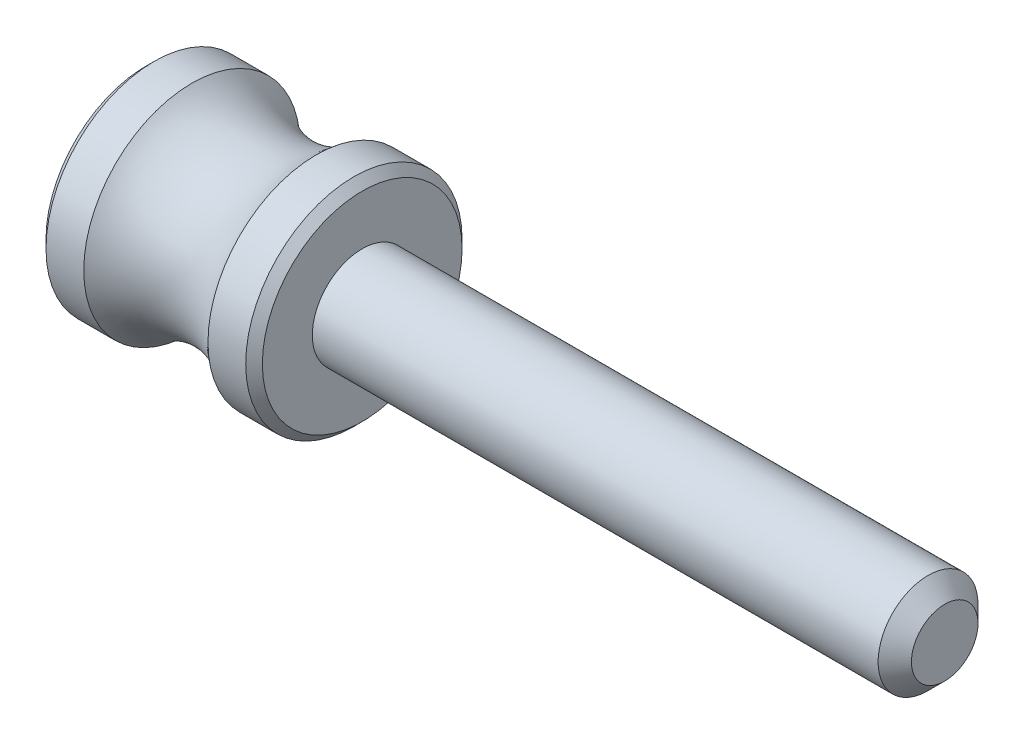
ISO-10303-21;
HEADER;
FILE_DESCRIPTION(('STEP AP214'),'2;1');
FILE_NAME('part.step','',(''),(''),'','','');
FILE_SCHEMA(('AUTOMOTIVE_DESIGN { 1 0 10303 214 1 1 1 1 }'));
ENDSEC;
DATA;
#1=APPLICATION_CONTEXT('core data for automotive mechanical design processes');
#2=APPLICATION_PROTOCOL_DEFINITION('international standard','automotive_design',2000,#1);
#3=PRODUCT_CONTEXT('',#1,'mechanical');
#4=PRODUCT('Part','Part','',(#3));
#5=PRODUCT_RELATED_PRODUCT_CATEGORY('part','',(#4));
#6=PRODUCT_DEFINITION_FORMATION('','',#4);
#7=PRODUCT_DEFINITION_CONTEXT('part definition',#1,'design');
#8=PRODUCT_DEFINITION('design','',#6,#7);
#9=PRODUCT_DEFINITION_SHAPE('','',#8);
#10=(LENGTH_UNIT() NAMED_UNIT(*) SI_UNIT(.MILLI.,.METRE.));
#11=(NAMED_UNIT(*) PLANE_ANGLE_UNIT() SI_UNIT($,.RADIAN.));
#12=(NAMED_UNIT(*) SI_UNIT($,.STERADIAN.) SOLID_ANGLE_UNIT());
#13=UNCERTAINTY_MEASURE_WITH_UNIT(LENGTH_MEASURE(1.E-05),#10,'distance_accuracy_value','');
#14=(GEOMETRIC_REPRESENTATION_CONTEXT(3) GLOBAL_UNCERTAINTY_ASSIGNED_CONTEXT((#13)) GLOBAL_UNIT_ASSIGNED_CONTEXT((#10,
#11,#12)) REPRESENTATION_CONTEXT('',''));
#15=CARTESIAN_POINT('',(0.,0.,0.));
#16=DIRECTION('',(0.,0.,1.));
#17=DIRECTION('',(1.,0.,0.));
#18=AXIS2_PLACEMENT_3D('',#15,#16,#17);
#19=CARTESIAN_POINT('',(13.,0.,0.));
#20=DIRECTION('',(-1.,0.,0.));
#21=DIRECTION('',(0.,0.,1.));
#22=AXIS2_PLACEMENT_3D('',#19,#20,#21);
#23=CYLINDRICAL_SURFACE('',#22,6.5);
#24=CARTESIAN_POINT('',(0.500000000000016,0.,0.));
#25=DIRECTION('',(1.,0.,0.));
#26=DIRECTION('',(0.,0.,-1.));
#27=AXIS2_PLACEMENT_3D('',#24,#25,#26);
#28=CIRCLE('',#27,6.5);
#29=CARTESIAN_POINT('',(0.500000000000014,0.,6.5));
#30=VERTEX_POINT('',#29);
#31=EDGE_CURVE('E45',#30,#30,#28,.T.);
#32=CARTESIAN_POINT('',(2.76787230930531,0.,0.));
#33=DIRECTION('',(-1.,0.,0.));
#34=DIRECTION('',(0.,0.,1.));
#35=AXIS2_PLACEMENT_3D('',#32,#33,#34);
#36=CIRCLE('',#35,6.5);
#37=CARTESIAN_POINT('',(2.76787230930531,0.,6.5));
#38=VERTEX_POINT('',#37);
#39=EDGE_CURVE('E59',#38,#38,#36,.T.);
#40=CARTESIAN_POINT('',(0.500000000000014,0.,6.5));
#41=CARTESIAN_POINT('',(0.523623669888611,0.,6.5));
#42=CARTESIAN_POINT('',(0.547247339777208,0.,6.5));
#43=CARTESIAN_POINT('',(0.594494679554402,0.,6.5));
#44=CARTESIAN_POINT('',(0.618118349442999,0.,6.5));
#45=CARTESIAN_POINT('',(0.665365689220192,0.,6.5));
#46=CARTESIAN_POINT('',(0.688989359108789,0.,6.5));
#47=CARTESIAN_POINT('',(0.736236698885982,0.,6.5));
#48=CARTESIAN_POINT('',(0.759860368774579,0.,6.5));
#49=CARTESIAN_POINT('',(0.807107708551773,0.,6.5));
#50=CARTESIAN_POINT('',(0.83073137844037,0.,6.5));
#51=CARTESIAN_POINT('',(0.877978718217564,0.,6.5));
#52=CARTESIAN_POINT('',(0.901602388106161,0.,6.5));
#53=CARTESIAN_POINT('',(0.948849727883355,0.,6.5));
#54=CARTESIAN_POINT('',(0.972473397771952,0.,6.5));
#55=CARTESIAN_POINT('',(1.01972073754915,0.,6.5));
#56=CARTESIAN_POINT('',(1.04334440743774,0.,6.5));
#57=CARTESIAN_POINT('',(1.09059174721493,0.,6.5));
#58=CARTESIAN_POINT('',(1.11421541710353,0.,6.5));
#59=CARTESIAN_POINT('',(1.16146275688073,0.,6.5));
#60=CARTESIAN_POINT('',(1.18508642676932,0.,6.5));
#61=CARTESIAN_POINT('',(1.23233376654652,0.,6.5));
#62=CARTESIAN_POINT('',(1.25595743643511,0.,6.5));
#63=CARTESIAN_POINT('',(1.30320477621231,0.,6.5));
#64=CARTESIAN_POINT('',(1.3268284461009,0.,6.5));
#65=CARTESIAN_POINT('',(1.3740757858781,0.,6.5));
#66=CARTESIAN_POINT('',(1.3976994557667,0.,6.5));
#67=CARTESIAN_POINT('',(1.44494679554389,0.,6.5));
#68=CARTESIAN_POINT('',(1.46857046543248,0.,6.5));
#69=CARTESIAN_POINT('',(1.51581780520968,0.,6.5));
#70=CARTESIAN_POINT('',(1.53944147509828,0.,6.5));
#71=CARTESIAN_POINT('',(1.58668881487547,0.,6.5));
#72=CARTESIAN_POINT('',(1.61031248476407,0.,6.5));
#73=CARTESIAN_POINT('',(1.65755982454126,0.,6.5));
#74=CARTESIAN_POINT('',(1.68118349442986,0.,6.5));
#75=CARTESIAN_POINT('',(1.72843083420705,0.,6.5));
#76=CARTESIAN_POINT('',(1.75205450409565,0.,6.5));
#77=CARTESIAN_POINT('',(1.79930184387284,0.,6.5));
#78=CARTESIAN_POINT('',(1.82292551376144,0.,6.5));
#79=CARTESIAN_POINT('',(1.87017285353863,0.,6.5));
#80=CARTESIAN_POINT('',(1.89379652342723,0.,6.5));
#81=CARTESIAN_POINT('',(1.94104386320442,0.,6.5));
#82=CARTESIAN_POINT('',(1.96466753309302,0.,6.5));
#83=CARTESIAN_POINT('',(2.01191487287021,0.,6.5));
#84=CARTESIAN_POINT('',(2.03553854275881,0.,6.5));
#85=CARTESIAN_POINT('',(2.082785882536,0.,6.5));
#86=CARTESIAN_POINT('',(2.1064095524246,0.,6.5));
#87=CARTESIAN_POINT('',(2.15365689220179,0.,6.5));
#88=CARTESIAN_POINT('',(2.17728056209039,0.,6.5));
#89=CARTESIAN_POINT('',(2.22452790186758,0.,6.5));
#90=CARTESIAN_POINT('',(2.24815157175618,0.,6.5));
#91=CARTESIAN_POINT('',(2.29539891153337,0.,6.5));
#92=CARTESIAN_POINT('',(2.31902258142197,0.,6.5));
#93=CARTESIAN_POINT('',(2.36626992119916,0.,6.5));
#94=CARTESIAN_POINT('',(2.38989359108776,0.,6.5));
#95=CARTESIAN_POINT('',(2.43714093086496,0.,6.5));
#96=CARTESIAN_POINT('',(2.46076460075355,0.,6.5));
#97=CARTESIAN_POINT('',(2.50801194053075,0.,6.5));
#98=CARTESIAN_POINT('',(2.53163561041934,0.,6.5));
#99=CARTESIAN_POINT('',(2.57888295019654,0.,6.5));
#100=CARTESIAN_POINT('',(2.60250662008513,0.,6.5));
#101=CARTESIAN_POINT('',(2.64975395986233,0.,6.5));
#102=CARTESIAN_POINT('',(2.67337762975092,0.,6.5));
#103=CARTESIAN_POINT('',(2.72062496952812,0.,6.5));
#104=CARTESIAN_POINT('',(2.74424863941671,0.,6.5));
#105=CARTESIAN_POINT('',(2.76787230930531,0.,6.5));
#106=B_SPLINE_CURVE_WITH_KNOTS('',3,(#40,#41,#42,#43,#44,#45,#46,#47,#48,#49,#50,#51,#52,#53,
#54,#55,#56,#57,#58,#59,#60,#61,#62,#63,#64,#65,#66,#67,#68,#69,#70,#71,#72,#73,#74,#75,#76,#77,
#78,#79,#80,#81,#82,#83,#84,#85,#86,#87,#88,#89,#90,#91,#92,#93,#94,#95,#96,#97,#98,#99,#100,
#101,#102,#103,#104,#105),.UNSPECIFIED.,.F.,.F.,(4,2,2,2,2,2,2,2,2,2,2,2,2,2,2,2,2,2,2,2,2,2,2,
2,2,2,2,2,2,2,2,2,4),(0.,0.0708710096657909,0.141742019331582,0.212613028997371,
0.283484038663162,0.354355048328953,0.425226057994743,0.496097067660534,0.566968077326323,
0.637839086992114,0.708710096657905,0.779581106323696,0.850452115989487,0.921323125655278,
0.992194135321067,1.06306514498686,1.13393615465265,1.20480716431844,1.27567817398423,
1.34654918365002,1.41742019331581,1.4882912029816,1.55916221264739,1.63003322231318,
1.70090423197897,1.77177524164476,1.84264625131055,1.91351726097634,1.98438827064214,
2.05525928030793,2.12613028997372,2.19700129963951,2.2678723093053),.UNSPECIFIED.);
#107=EDGE_CURVE('BSEAM30',#30,#38,#106,.T.);
#108=ORIENTED_EDGE('',*,*,#31,.T.);
#109=ORIENTED_EDGE('',*,*,#39,.T.);
#110=ORIENTED_EDGE('',*,*,#107,.T.);
#111=ORIENTED_EDGE('',*,*,#107,.F.);
#112=EDGE_LOOP('',(#108,#110,#109,#111));
#113=FACE_BOUND('',#112,.T.);
#114=ADVANCED_FACE('F30',(#113),#23,.T.);
#115=CARTESIAN_POINT('',(0.,0.,0.));
#116=DIRECTION('',(1.,0.,0.));
#117=DIRECTION('',(0.,0.,-1.));
#118=AXIS2_PLACEMENT_3D('',#115,#116,#117);
#119=PLANE('',#118);
#120=CARTESIAN_POINT('',(0.,0.,0.));
#121=DIRECTION('',(1.,0.,0.));
#122=DIRECTION('',(0.,0.,-1.));
#123=AXIS2_PLACEMENT_3D('',#120,#121,#122);
#124=CIRCLE('',#123,5.99999999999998);
#125=CARTESIAN_POINT('',(0.,0.,-5.99999999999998));
#126=VERTEX_POINT('',#125);
#127=EDGE_CURVE('E41',#126,#126,#124,.F.);
#128=ORIENTED_EDGE('',*,*,#127,.T.);
#129=EDGE_LOOP('',(#128));
#130=FACE_BOUND('',#129,.T.);
#131=ADVANCED_FACE('F90',(#130),#119,.F.);
#132=CARTESIAN_POINT('',(6.5,0.,0.));
#133=DIRECTION('',(-1.,0.,0.));
#134=DIRECTION('',(0.,0.,1.));
#135=AXIS2_PLACEMENT_3D('',#132,#133,#134);
#136=TOROIDAL_SURFACE('',#135,10.5,5.47071998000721);
#137=CARTESIAN_POINT('',(10.2321276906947,0.,0.));
#138=DIRECTION('',(-1.,0.,0.));
#139=DIRECTION('',(0.,0.,1.));
#140=AXIS2_PLACEMENT_3D('',#137,#138,#139);
#141=CIRCLE('',#140,6.5);
#142=CARTESIAN_POINT('',(10.2321276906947,0.,6.5));
#143=VERTEX_POINT('',#142);
#144=EDGE_CURVE('E56',#143,#143,#141,.T.);
#145=ORIENTED_EDGE('',*,*,#144,.T.);
#146=EDGE_LOOP('',(#145));
#147=FACE_BOUND('',#146,.T.);
#148=ORIENTED_EDGE('',*,*,#39,.F.);
#149=EDGE_LOOP('',(#148));
#150=FACE_BOUND('',#149,.T.);
#151=ADVANCED_FACE('F72',(#147,#150),#136,.F.);
#152=CARTESIAN_POINT('',(13.,0.,0.));
#153=DIRECTION('',(1.,0.,0.));
#154=DIRECTION('',(0.,0.,-1.));
#155=AXIS2_PLACEMENT_3D('',#152,#153,#154);
#156=PLANE('',#155);
#157=CARTESIAN_POINT('',(13.,0.,0.));
#158=DIRECTION('',(1.,0.,0.));
#159=DIRECTION('',(0.,0.,-1.));
#160=AXIS2_PLACEMENT_3D('',#157,#158,#159);
#161=CIRCLE('',#160,3.);
#162=CARTESIAN_POINT('',(13.,0.,-3.));
#163=VERTEX_POINT('',#162);
#164=EDGE_CURVE('E62',#163,#163,#161,.T.);
#165=ORIENTED_EDGE('',*,*,#164,.F.);
#166=EDGE_LOOP('',(#165));
#167=FACE_BOUND('',#166,.T.);
#168=CARTESIAN_POINT('',(13.,0.,0.));
#169=DIRECTION('',(1.,0.,0.));
#170=DIRECTION('',(0.,0.,-1.));
#171=AXIS2_PLACEMENT_3D('',#168,#169,#170);
#172=CIRCLE('',#171,6.00000000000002);
#173=CARTESIAN_POINT('',(13.,0.,-6.00000000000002));
#174=VERTEX_POINT('',#173);
#175=EDGE_CURVE('E53',#174,#174,#172,.T.);
#176=ORIENTED_EDGE('',*,*,#175,.T.);
#177=EDGE_LOOP('',(#176));
#178=FACE_BOUND('',#177,.T.);
#179=ADVANCED_FACE('F68',(#167,#178),#156,.T.);
#180=CARTESIAN_POINT('',(12.5,0.,0.));
#181=DIRECTION('',(1.,0.,0.));
#182=DIRECTION('',(0.,0.,-1.));
#183=AXIS2_PLACEMENT_3D('',#180,#181,#182);
#184=CIRCLE('',#183,6.5);
#185=CARTESIAN_POINT('',(12.5,0.,6.5));
#186=VERTEX_POINT('',#185);
#187=EDGE_CURVE('E50',#186,#186,#184,.F.);
#188=CARTESIAN_POINT('',(12.5,0.,6.5));
#189=CARTESIAN_POINT('',(12.4763763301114,0.,6.5));
#190=CARTESIAN_POINT('',(12.4527526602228,0.,6.5));
#191=CARTESIAN_POINT('',(12.4055053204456,0.,6.5));
#192=CARTESIAN_POINT('',(12.381881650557,0.,6.5));
#193=CARTESIAN_POINT('',(12.3346343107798,0.,6.5));
#194=CARTESIAN_POINT('',(12.3110106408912,0.,6.5));
#195=CARTESIAN_POINT('',(12.263763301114,0.,6.5));
#196=CARTESIAN_POINT('',(12.2401396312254,0.,6.5));
#197=CARTESIAN_POINT('',(12.1928922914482,0.,6.5));
#198=CARTESIAN_POINT('',(12.1692686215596,0.,6.5));
#199=CARTESIAN_POINT('',(12.1220212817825,0.,6.5));
#200=CARTESIAN_POINT('',(12.0983976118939,0.,6.5));
#201=CARTESIAN_POINT('',(12.0511502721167,0.,6.5));
#202=CARTESIAN_POINT('',(12.0275266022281,0.,6.5));
#203=CARTESIAN_POINT('',(11.9802792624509,0.,6.5));
#204=CARTESIAN_POINT('',(11.9566555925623,0.,6.5));
#205=CARTESIAN_POINT('',(11.9094082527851,0.,6.5));
#206=CARTESIAN_POINT('',(11.8857845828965,0.,6.5));
#207=CARTESIAN_POINT('',(11.8385372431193,0.,6.5));
#208=CARTESIAN_POINT('',(11.8149135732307,0.,6.5));
#209=CARTESIAN_POINT('',(11.7676662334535,0.,6.5));
#210=CARTESIAN_POINT('',(11.7440425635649,0.,6.5));
#211=CARTESIAN_POINT('',(11.6967952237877,0.,6.5));
#212=CARTESIAN_POINT('',(11.6731715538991,0.,6.5));
#213=CARTESIAN_POINT('',(11.6259242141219,0.,6.5));
#214=CARTESIAN_POINT('',(11.6023005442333,0.,6.5));
#215=CARTESIAN_POINT('',(11.5550532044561,0.,6.5));
#216=CARTESIAN_POINT('',(11.5314295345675,0.,6.5));
#217=CARTESIAN_POINT('',(11.4841821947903,0.,6.5));
#218=CARTESIAN_POINT('',(11.4605585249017,0.,6.5));
#219=CARTESIAN_POINT('',(11.4133111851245,0.,6.5));
#220=CARTESIAN_POINT('',(11.3896875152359,0.,6.5));
#221=CARTESIAN_POINT('',(11.3424401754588,0.,6.5));
#222=CARTESIAN_POINT('',(11.3188165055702,0.,6.5));
#223=CARTESIAN_POINT('',(11.271569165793,0.,6.5));
#224=CARTESIAN_POINT('',(11.2479454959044,0.,6.5));
#225=CARTESIAN_POINT('',(11.2006981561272,0.,6.5));
#226=CARTESIAN_POINT('',(11.1770744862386,0.,6.5));
#227=CARTESIAN_POINT('',(11.1298271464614,0.,6.5));
#228=CARTESIAN_POINT('',(11.1062034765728,0.,6.5));
#229=CARTESIAN_POINT('',(11.0589561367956,0.,6.5));
#230=CARTESIAN_POINT('',(11.035332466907,0.,6.5));
#231=CARTESIAN_POINT('',(10.9880851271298,0.,6.5));
#232=CARTESIAN_POINT('',(10.9644614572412,0.,6.5));
#233=CARTESIAN_POINT('',(10.917214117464,0.,6.5));
#234=CARTESIAN_POINT('',(10.8935904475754,0.,6.5));
#235=CARTESIAN_POINT('',(10.8463431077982,0.,6.5));
#236=CARTESIAN_POINT('',(10.8227194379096,0.,6.5));
#237=CARTESIAN_POINT('',(10.7754720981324,0.,6.5));
#238=CARTESIAN_POINT('',(10.7518484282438,0.,6.5));
#239=CARTESIAN_POINT('',(10.7046010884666,0.,6.5));
#240=CARTESIAN_POINT('',(10.680977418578,0.,6.5));
#241=CARTESIAN_POINT('',(10.6337300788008,0.,6.5));
#242=CARTESIAN_POINT('',(10.6101064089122,0.,6.5));
#243=CARTESIAN_POINT('',(10.562859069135,0.,6.5));
#244=CARTESIAN_POINT('',(10.5392353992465,0.,6.5));
#245=CARTESIAN_POINT('',(10.4919880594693,0.,6.5));
#246=CARTESIAN_POINT('',(10.4683643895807,0.,6.5));
#247=CARTESIAN_POINT('',(10.4211170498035,0.,6.5));
#248=CARTESIAN_POINT('',(10.3974933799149,0.,6.5));
#249=CARTESIAN_POINT('',(10.3502460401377,0.,6.5));
#250=CARTESIAN_POINT('',(10.3266223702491,0.,6.5));
#251=CARTESIAN_POINT('',(10.2793750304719,0.,6.5));
#252=CARTESIAN_POINT('',(10.2557513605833,0.,6.5));
#253=CARTESIAN_POINT('',(10.2321276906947,0.,6.5));
#254=B_SPLINE_CURVE_WITH_KNOTS('',3,(#188,#189,#190,#191,#192,#193,#194,#195,#196,#197,#198,
#199,#200,#201,#202,#203,#204,#205,#206,#207,#208,#209,#210,#211,#212,#213,#214,#215,#216,#217,
#218,#219,#220,#221,#222,#223,#224,#225,#226,#227,#228,#229,#230,#231,#232,#233,#234,#235,#236,
#237,#238,#239,#240,#241,#242,#243,#244,#245,#246,#247,#248,#249,#250,#251,#252,#253),
.UNSPECIFIED.,.F.,.F.,(4,2,2,2,2,2,2,2,2,2,2,2,2,2,2,2,2,2,2,2,2,2,2,2,2,2,2,2,2,2,2,2,4),(0.,
0.0708710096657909,0.141742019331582,0.212613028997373,0.283484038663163,0.354355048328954,
0.425226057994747,0.496097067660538,0.566968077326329,0.63783908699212,0.70871009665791,
0.779581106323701,0.850452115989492,0.921323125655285,0.992194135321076,1.06306514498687,
1.13393615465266,1.20480716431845,1.27567817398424,1.34654918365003,1.41742019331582,
1.48829120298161,1.5591622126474,1.6300332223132,1.70090423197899,1.77177524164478,
1.84264625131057,1.91351726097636,1.98438827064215,2.05525928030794,2.12613028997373,
2.19700129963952,2.26787230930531),.UNSPECIFIED.);
#255=EDGE_CURVE('BSEAM71',#186,#143,#254,.T.);
#256=ORIENTED_EDGE('',*,*,#187,.T.);
#257=ORIENTED_EDGE('',*,*,#144,.F.);
#258=ORIENTED_EDGE('',*,*,#255,.T.);
#259=ORIENTED_EDGE('',*,*,#255,.F.);
#260=EDGE_LOOP('',(#256,#258,#257,#259));
#261=FACE_BOUND('',#260,.T.);
#262=ADVANCED_FACE('F71',(#261),#23,.T.);
#263=CARTESIAN_POINT('',(13.,0.,0.));
#264=DIRECTION('',(-1.,0.,0.));
#265=DIRECTION('',(0.,0.,1.));
#266=AXIS2_PLACEMENT_3D('',#263,#264,#265);
#267=CONICAL_SURFACE('',#266,6.00000000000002,0.785398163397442);
#268=ORIENTED_EDGE('',*,*,#187,.F.);
#269=EDGE_LOOP('',(#268));
#270=FACE_BOUND('',#269,.T.);
#271=ORIENTED_EDGE('',*,*,#175,.F.);
#272=EDGE_LOOP('',(#271));
#273=FACE_BOUND('',#272,.T.);
#274=ADVANCED_FACE('F76',(#270,#273),#267,.T.);
#275=CARTESIAN_POINT('',(0.500000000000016,0.,0.));
#276=DIRECTION('',(1.,0.,0.));
#277=DIRECTION('',(0.,0.,-1.));
#278=AXIS2_PLACEMENT_3D('',#275,#276,#277);
#279=CONICAL_SURFACE('',#278,6.5,0.78539816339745);
#280=ORIENTED_EDGE('',*,*,#127,.F.);
#281=EDGE_LOOP('',(#280));
#282=FACE_BOUND('',#281,.T.);
#283=ORIENTED_EDGE('',*,*,#31,.F.);
#284=EDGE_LOOP('',(#283));
#285=FACE_BOUND('',#284,.T.);
#286=ADVANCED_FACE('F78',(#282,#285),#279,.T.);
#287=CARTESIAN_POINT('',(48.,0.,0.));
#288=DIRECTION('',(-1.,0.,0.));
#289=DIRECTION('',(0.,0.,1.));
#290=AXIS2_PLACEMENT_3D('',#287,#288,#289);
#291=CYLINDRICAL_SURFACE('',#290,3.);
#292=CARTESIAN_POINT('',(47.,0.,0.));
#293=DIRECTION('',(1.,0.,0.));
#294=DIRECTION('',(0.,0.,-1.));
#295=AXIS2_PLACEMENT_3D('',#292,#293,#294);
#296=CIRCLE('',#295,3.);
#297=CARTESIAN_POINT('',(47.,0.,-3.));
#298=VERTEX_POINT('',#297);
#299=EDGE_CURVE('E10',#298,#298,#296,.F.);
#300=ORIENTED_EDGE('',*,*,#299,.T.);
#301=EDGE_LOOP('',(#300));
#302=FACE_BOUND('',#301,.T.);
#303=ORIENTED_EDGE('',*,*,#164,.T.);
#304=EDGE_LOOP('',(#303));
#305=FACE_BOUND('',#304,.T.);
#306=ADVANCED_FACE('F66',(#302,#305),#291,.T.);
#307=CARTESIAN_POINT('',(48.,0.,0.));
#308=DIRECTION('',(1.,0.,0.));
#309=DIRECTION('',(0.,0.,-1.));
#310=AXIS2_PLACEMENT_3D('',#307,#308,#309);
#311=PLANE('',#310);
#312=CARTESIAN_POINT('',(48.,0.,0.));
#313=DIRECTION('',(1.,0.,0.));
#314=DIRECTION('',(0.,0.,-1.));
#315=AXIS2_PLACEMENT_3D('',#312,#313,#314);
#316=CIRCLE('',#315,1.99999999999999);
#317=CARTESIAN_POINT('',(48.,0.,-1.99999999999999));
#318=VERTEX_POINT('',#317);
#319=EDGE_CURVE('E37',#318,#318,#316,.T.);
#320=ORIENTED_EDGE('',*,*,#319,.T.);
#321=EDGE_LOOP('',(#320));
#322=FACE_BOUND('',#321,.T.);
#323=ADVANCED_FACE('F104',(#322),#311,.T.);
#324=CARTESIAN_POINT('',(48.,0.,0.));
#325=DIRECTION('',(-1.,0.,0.));
#326=DIRECTION('',(0.,0.,1.));
#327=AXIS2_PLACEMENT_3D('',#324,#325,#326);
#328=CONICAL_SURFACE('',#327,1.99999999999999,0.785398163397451);
#329=ORIENTED_EDGE('',*,*,#299,.F.);
#330=EDGE_LOOP('',(#329));
#331=FACE_BOUND('',#330,.T.);
#332=ORIENTED_EDGE('',*,*,#319,.F.);
#333=EDGE_LOOP('',(#332));
#334=FACE_BOUND('',#333,.T.);
#335=ADVANCED_FACE('F32',(#331,#334),#328,.T.);
#336=CLOSED_SHELL('',(#114,#131,#151,#179,#262,#274,#286,#306,#323,#335));
#337=MANIFOLD_SOLID_BREP('B2',#336);
#338=ADVANCED_BREP_SHAPE_REPRESENTATION('',(#18,#337),#14);
#339=SHAPE_DEFINITION_REPRESENTATION(#9,#338);
ENDSEC;
END-ISO-10303-21;
